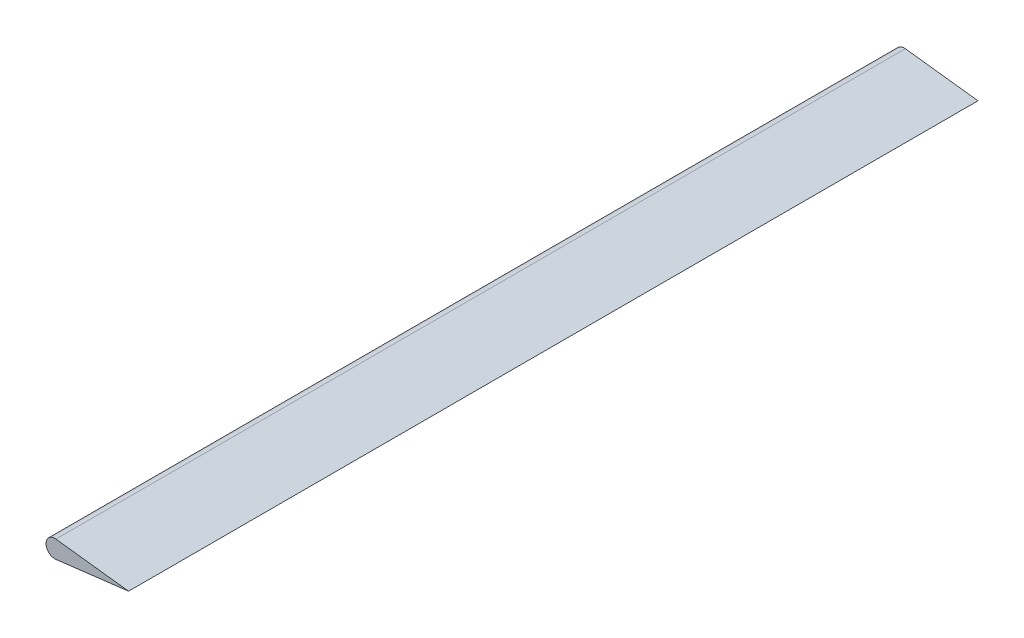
ISO-10303-21;
HEADER;
FILE_DESCRIPTION(('STEP AP214'),'2;1');
FILE_NAME('part.step','',(''),(''),'','','');
FILE_SCHEMA(('AUTOMOTIVE_DESIGN { 1 0 10303 214 1 1 1 1 }'));
ENDSEC;
DATA;
#1=APPLICATION_CONTEXT('core data for automotive mechanical design processes');
#2=APPLICATION_PROTOCOL_DEFINITION('international standard','automotive_design',2000,#1);
#3=PRODUCT_CONTEXT('',#1,'mechanical');
#4=PRODUCT('Part','Part','',(#3));
#5=PRODUCT_RELATED_PRODUCT_CATEGORY('part','',(#4));
#6=PRODUCT_DEFINITION_FORMATION('','',#4);
#7=PRODUCT_DEFINITION_CONTEXT('part definition',#1,'design');
#8=PRODUCT_DEFINITION('design','',#6,#7);
#9=PRODUCT_DEFINITION_SHAPE('','',#8);
#10=(LENGTH_UNIT() NAMED_UNIT(*) SI_UNIT(.MILLI.,.METRE.));
#11=(NAMED_UNIT(*) PLANE_ANGLE_UNIT() SI_UNIT($,.RADIAN.));
#12=(NAMED_UNIT(*) SI_UNIT($,.STERADIAN.) SOLID_ANGLE_UNIT());
#13=UNCERTAINTY_MEASURE_WITH_UNIT(LENGTH_MEASURE(1.E-05),#10,'distance_accuracy_value','');
#14=(GEOMETRIC_REPRESENTATION_CONTEXT(3) GLOBAL_UNCERTAINTY_ASSIGNED_CONTEXT((#13)) GLOBAL_UNIT_ASSIGNED_CONTEXT((#10,
#11,#12)) REPRESENTATION_CONTEXT('',''));
#15=CARTESIAN_POINT('',(0.,0.,0.));
#16=DIRECTION('',(0.,0.,1.));
#17=DIRECTION('',(1.,0.,0.));
#18=AXIS2_PLACEMENT_3D('',#15,#16,#17);
#19=CARTESIAN_POINT('',(-8.88178419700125E-13,0.,1828.8));
#20=DIRECTION('',(0.,0.,-1.));
#21=DIRECTION('',(-1.,0.,0.));
#22=AXIS2_PLACEMENT_3D('',#19,#20,#21);
#23=CYLINDRICAL_SURFACE('',#22,19.05);
#24=DIRECTION('',(0.,0.,-1.));
#25=VECTOR('',#24,1.);
#26=CARTESIAN_POINT('',(2.28600000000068,-18.9123426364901,1828.8));
#27=LINE('',#26,#25);
#28=CARTESIAN_POINT('',(2.28600000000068,-18.9123426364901,1828.8));
#29=VERTEX_POINT('',#28);
#30=CARTESIAN_POINT('',(2.28600000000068,-18.9123426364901,3.33066907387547E-13));
#31=VERTEX_POINT('',#30);
#32=EDGE_CURVE('E11',#29,#31,#27,.T.);
#33=ORIENTED_EDGE('',*,*,#32,.F.);
#34=CARTESIAN_POINT('',(-8.88178419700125E-13,0.,1828.8));
#35=DIRECTION('',(0.,0.,1.));
#36=DIRECTION('',(1.,0.,0.));
#37=AXIS2_PLACEMENT_3D('',#34,#35,#36);
#38=CIRCLE('',#37,19.05);
#39=CARTESIAN_POINT('',(2.2859999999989,18.9123426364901,1828.8));
#40=VERTEX_POINT('',#39);
#41=EDGE_CURVE('E79',#40,#29,#38,.T.);
#42=ORIENTED_EDGE('',*,*,#41,.F.);
#43=DIRECTION('',(0.,0.,-1.));
#44=VECTOR('',#43,1.);
#45=CARTESIAN_POINT('',(2.2859999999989,18.9123426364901,1828.8));
#46=LINE('',#45,#44);
#47=CARTESIAN_POINT('',(2.28599999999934,18.9123426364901,1.11022302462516E-13));
#48=VERTEX_POINT('',#47);
#49=EDGE_CURVE('E48',#40,#48,#46,.T.);
#50=ORIENTED_EDGE('',*,*,#49,.T.);
#51=CARTESIAN_POINT('',(-8.88178419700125E-13,0.,3.33066907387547E-13));
#52=DIRECTION('',(0.,0.,1.));
#53=DIRECTION('',(1.,0.,0.));
#54=AXIS2_PLACEMENT_3D('',#51,#52,#53);
#55=CIRCLE('',#54,19.05);
#56=EDGE_CURVE('E73',#48,#31,#55,.T.);
#57=ORIENTED_EDGE('',*,*,#56,.T.);
#58=EDGE_LOOP('',(#33,#42,#50,#57));
#59=FACE_BOUND('',#58,.T.);
#60=ADVANCED_FACE('F33',(#59),#23,.T.);
#61=CARTESIAN_POINT('',(2.28600000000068,-18.9123426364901,1828.8));
#62=DIRECTION('',(-0.12,0.992773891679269,0.));
#63=DIRECTION('',(-0.992773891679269,-0.12,0.));
#64=AXIS2_PLACEMENT_3D('',#61,#62,#63);
#65=PLANE('',#64);
#66=DIRECTION('',(0.,0.,-1.));
#67=VECTOR('',#66,1.);
#68=CARTESIAN_POINT('',(158.75,1.11022302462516E-13,1828.8));
#69=LINE('',#68,#67);
#70=CARTESIAN_POINT('',(158.75,1.11022302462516E-13,1828.8));
#71=VERTEX_POINT('',#70);
#72=CARTESIAN_POINT('',(158.75,0.,1.11022302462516E-13));
#73=VERTEX_POINT('',#72);
#74=EDGE_CURVE('E41',#71,#73,#69,.T.);
#75=ORIENTED_EDGE('',*,*,#74,.F.);
#76=DIRECTION('',(0.992773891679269,0.12,0.));
#77=VECTOR('',#76,1.);
#78=CARTESIAN_POINT('',(2.28600000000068,-18.9123426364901,1828.8));
#79=LINE('',#78,#77);
#80=EDGE_CURVE('E69',#29,#71,#79,.T.);
#81=ORIENTED_EDGE('',*,*,#80,.F.);
#82=ORIENTED_EDGE('',*,*,#32,.T.);
#83=DIRECTION('',(0.992773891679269,0.12,0.));
#84=VECTOR('',#83,1.);
#85=CARTESIAN_POINT('',(2.28600000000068,-18.9123426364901,3.33066907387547E-13));
#86=LINE('',#85,#84);
#87=EDGE_CURVE('E67',#31,#73,#86,.T.);
#88=ORIENTED_EDGE('',*,*,#87,.T.);
#89=EDGE_LOOP('',(#75,#81,#82,#88));
#90=FACE_BOUND('',#89,.T.);
#91=ADVANCED_FACE('F35',(#90),#65,.F.);
#92=CARTESIAN_POINT('',(2.2859999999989,18.9123426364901,1828.8));
#93=DIRECTION('',(0.12,0.992773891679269,0.));
#94=DIRECTION('',(-0.992773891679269,0.12,0.));
#95=AXIS2_PLACEMENT_3D('',#92,#93,#94);
#96=PLANE('',#95);
#97=DIRECTION('',(0.992773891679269,-0.12,0.));
#98=VECTOR('',#97,1.);
#99=CARTESIAN_POINT('',(2.2859999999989,18.9123426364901,1828.8));
#100=LINE('',#99,#98);
#101=EDGE_CURVE('E84',#40,#71,#100,.T.);
#102=ORIENTED_EDGE('',*,*,#101,.T.);
#103=ORIENTED_EDGE('',*,*,#74,.T.);
#104=DIRECTION('',(0.992773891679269,-0.12,0.));
#105=VECTOR('',#104,1.);
#106=CARTESIAN_POINT('',(2.28599999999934,18.9123426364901,1.11022302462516E-13));
#107=LINE('',#106,#105);
#108=EDGE_CURVE('E77',#48,#73,#107,.T.);
#109=ORIENTED_EDGE('',*,*,#108,.F.);
#110=ORIENTED_EDGE('',*,*,#49,.F.);
#111=EDGE_LOOP('',(#102,#103,#109,#110));
#112=FACE_BOUND('',#111,.T.);
#113=ADVANCED_FACE('F86',(#112),#96,.T.);
#114=CARTESIAN_POINT('',(-8.88178419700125E-13,0.,1828.8));
#115=DIRECTION('',(0.,0.,1.));
#116=DIRECTION('',(1.,0.,0.));
#117=AXIS2_PLACEMENT_3D('',#114,#115,#116);
#118=PLANE('',#117);
#119=ORIENTED_EDGE('',*,*,#41,.T.);
#120=ORIENTED_EDGE('',*,*,#80,.T.);
#121=ORIENTED_EDGE('',*,*,#101,.F.);
#122=EDGE_LOOP('',(#119,#120,#121));
#123=FACE_BOUND('',#122,.T.);
#124=ADVANCED_FACE('F89',(#123),#118,.T.);
#125=CARTESIAN_POINT('',(-8.88178419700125E-13,0.,3.33066907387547E-13));
#126=DIRECTION('',(0.,0.,1.));
#127=DIRECTION('',(1.,0.,0.));
#128=AXIS2_PLACEMENT_3D('',#125,#126,#127);
#129=PLANE('',#128);
#130=ORIENTED_EDGE('',*,*,#56,.F.);
#131=ORIENTED_EDGE('',*,*,#108,.T.);
#132=ORIENTED_EDGE('',*,*,#87,.F.);
#133=EDGE_LOOP('',(#130,#131,#132));
#134=FACE_BOUND('',#133,.T.);
#135=ADVANCED_FACE('F76',(#134),#129,.F.);
#136=CLOSED_SHELL('',(#60,#91,#113,#124,#135));
#137=MANIFOLD_SOLID_BREP('B2',#136);
#138=ADVANCED_BREP_SHAPE_REPRESENTATION('',(#18,#137),#14);
#139=SHAPE_DEFINITION_REPRESENTATION(#9,#138);
ENDSEC;
END-ISO-10303-21;
